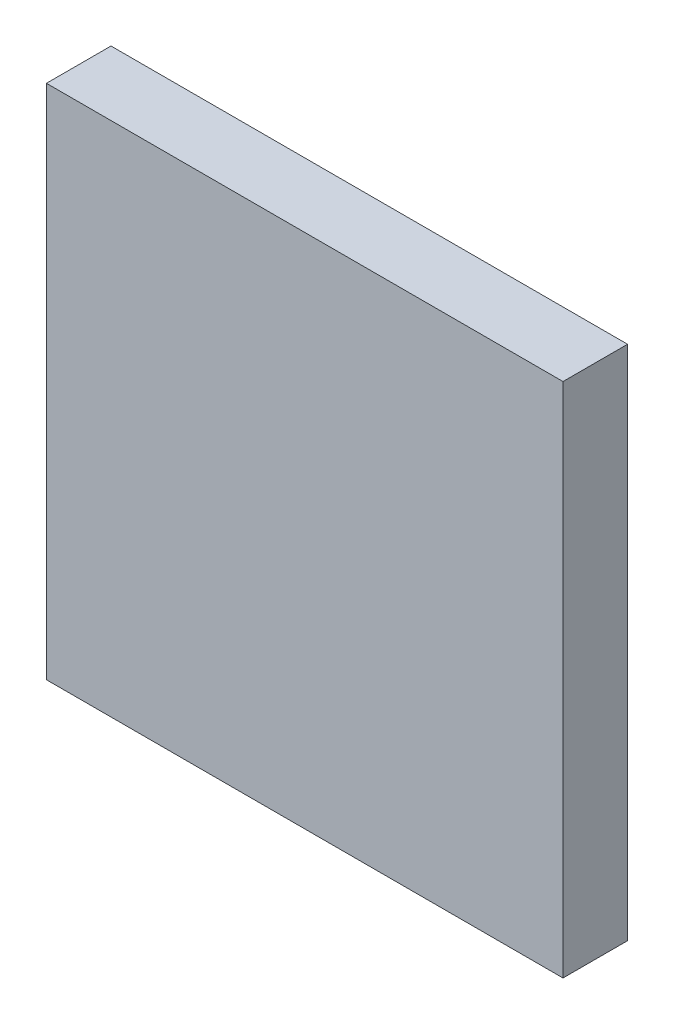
ISO-10303-21;
HEADER;
FILE_DESCRIPTION(('STEP AP214'),'2;1');
FILE_NAME('part.step','',(''),(''),'','','');
FILE_SCHEMA(('AUTOMOTIVE_DESIGN { 1 0 10303 214 1 1 1 1 }'));
ENDSEC;
DATA;
#1=APPLICATION_CONTEXT('core data for automotive mechanical design processes');
#2=APPLICATION_PROTOCOL_DEFINITION('international standard','automotive_design',2000,#1);
#3=PRODUCT_CONTEXT('',#1,'mechanical');
#4=PRODUCT('Part','Part','',(#3));
#5=PRODUCT_RELATED_PRODUCT_CATEGORY('part','',(#4));
#6=PRODUCT_DEFINITION_FORMATION('','',#4);
#7=PRODUCT_DEFINITION_CONTEXT('part definition',#1,'design');
#8=PRODUCT_DEFINITION('design','',#6,#7);
#9=PRODUCT_DEFINITION_SHAPE('','',#8);
#10=(LENGTH_UNIT() NAMED_UNIT(*) SI_UNIT(.MILLI.,.METRE.));
#11=(NAMED_UNIT(*) PLANE_ANGLE_UNIT() SI_UNIT($,.RADIAN.));
#12=(NAMED_UNIT(*) SI_UNIT($,.STERADIAN.) SOLID_ANGLE_UNIT());
#13=UNCERTAINTY_MEASURE_WITH_UNIT(LENGTH_MEASURE(1.E-05),#10,'distance_accuracy_value','');
#14=(GEOMETRIC_REPRESENTATION_CONTEXT(3) GLOBAL_UNCERTAINTY_ASSIGNED_CONTEXT((#13)) GLOBAL_UNIT_ASSIGNED_CONTEXT((#10,
#11,#12)) REPRESENTATION_CONTEXT('',''));
#15=CARTESIAN_POINT('',(0.,0.,0.));
#16=DIRECTION('',(0.,0.,1.));
#17=DIRECTION('',(1.,0.,0.));
#18=AXIS2_PLACEMENT_3D('',#15,#16,#17);
#19=CARTESIAN_POINT('',(76.2,76.2,-9.525));
#20=DIRECTION('',(0.,0.,-1.));
#21=DIRECTION('',(0.,1.,0.));
#22=AXIS2_PLACEMENT_3D('',#19,#20,#21);
#23=PLANE('',#22);
#24=DIRECTION('',(0.,-1.,0.));
#25=VECTOR('',#24,1.);
#26=CARTESIAN_POINT('',(-76.2,76.2,-9.525));
#27=LINE('',#26,#25);
#28=CARTESIAN_POINT('',(-76.2,76.2,-9.525));
#29=VERTEX_POINT('',#28);
#30=CARTESIAN_POINT('',(-76.2,-76.2,-9.52500000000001));
#31=VERTEX_POINT('',#30);
#32=EDGE_CURVE('E74',#29,#31,#27,.T.);
#33=ORIENTED_EDGE('',*,*,#32,.F.);
#34=DIRECTION('',(-1.,0.,0.));
#35=VECTOR('',#34,1.);
#36=CARTESIAN_POINT('',(76.2,76.2,-9.525));
#37=LINE('',#36,#35);
#38=CARTESIAN_POINT('',(76.2,76.2,-9.525));
#39=VERTEX_POINT('',#38);
#40=EDGE_CURVE('E11',#39,#29,#37,.T.);
#41=ORIENTED_EDGE('',*,*,#40,.F.);
#42=DIRECTION('',(0.,-1.,0.));
#43=VECTOR('',#42,1.);
#44=CARTESIAN_POINT('',(76.2,76.2,-9.525));
#45=LINE('',#44,#43);
#46=CARTESIAN_POINT('',(76.2,-76.2,-9.52500000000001));
#47=VERTEX_POINT('',#46);
#48=EDGE_CURVE('E75',#39,#47,#45,.T.);
#49=ORIENTED_EDGE('',*,*,#48,.T.);
#50=DIRECTION('',(-1.,0.,0.));
#51=VECTOR('',#50,1.);
#52=CARTESIAN_POINT('',(76.2,-76.2,-9.52500000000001));
#53=LINE('',#52,#51);
#54=EDGE_CURVE('E35',#47,#31,#53,.T.);
#55=ORIENTED_EDGE('',*,*,#54,.T.);
#56=EDGE_LOOP('',(#33,#41,#49,#55));
#57=FACE_BOUND('',#56,.T.);
#58=ADVANCED_FACE('F32',(#57),#23,.T.);
#59=CARTESIAN_POINT('',(76.2,76.2,-9.525));
#60=DIRECTION('',(0.,-1.,0.));
#61=DIRECTION('',(0.,0.,-1.));
#62=AXIS2_PLACEMENT_3D('',#59,#60,#61);
#63=PLANE('',#62);
#64=DIRECTION('',(0.,0.,1.));
#65=VECTOR('',#64,1.);
#66=CARTESIAN_POINT('',(-76.2,76.2,-9.525));
#67=LINE('',#66,#65);
#68=CARTESIAN_POINT('',(-76.2,76.2,9.52499999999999));
#69=VERTEX_POINT('',#68);
#70=EDGE_CURVE('E90',#29,#69,#67,.T.);
#71=ORIENTED_EDGE('',*,*,#70,.T.);
#72=DIRECTION('',(-1.,0.,0.));
#73=VECTOR('',#72,1.);
#74=CARTESIAN_POINT('',(76.2,76.2,9.52499999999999));
#75=LINE('',#74,#73);
#76=CARTESIAN_POINT('',(76.2,76.2,9.52499999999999));
#77=VERTEX_POINT('',#76);
#78=EDGE_CURVE('E40',#77,#69,#75,.T.);
#79=ORIENTED_EDGE('',*,*,#78,.F.);
#80=DIRECTION('',(0.,0.,1.));
#81=VECTOR('',#80,1.);
#82=CARTESIAN_POINT('',(76.2,76.2,-9.525));
#83=LINE('',#82,#81);
#84=EDGE_CURVE('E53',#39,#77,#83,.T.);
#85=ORIENTED_EDGE('',*,*,#84,.F.);
#86=ORIENTED_EDGE('',*,*,#40,.T.);
#87=EDGE_LOOP('',(#71,#79,#85,#86));
#88=FACE_BOUND('',#87,.T.);
#89=ADVANCED_FACE('F105',(#88),#63,.F.);
#90=CARTESIAN_POINT('',(76.2,-76.2,9.52499999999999));
#91=DIRECTION('',(0.,0.,1.));
#92=DIRECTION('',(1.,0.,0.));
#93=AXIS2_PLACEMENT_3D('',#90,#91,#92);
#94=PLANE('',#93);
#95=DIRECTION('',(0.,1.,0.));
#96=VECTOR('',#95,1.);
#97=CARTESIAN_POINT('',(-76.2,-76.2,9.52499999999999));
#98=LINE('',#97,#96);
#99=CARTESIAN_POINT('',(-76.2,-76.2,9.52499999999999));
#100=VERTEX_POINT('',#99);
#101=EDGE_CURVE('E85',#100,#69,#98,.T.);
#102=ORIENTED_EDGE('',*,*,#101,.F.);
#103=DIRECTION('',(-1.,0.,0.));
#104=VECTOR('',#103,1.);
#105=CARTESIAN_POINT('',(76.2,-76.2,9.52499999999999));
#106=LINE('',#105,#104);
#107=CARTESIAN_POINT('',(76.2,-76.2,9.52499999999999));
#108=VERTEX_POINT('',#107);
#109=EDGE_CURVE('E78',#108,#100,#106,.T.);
#110=ORIENTED_EDGE('',*,*,#109,.F.);
#111=DIRECTION('',(0.,1.,0.));
#112=VECTOR('',#111,1.);
#113=CARTESIAN_POINT('',(76.2,-76.2,9.52499999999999));
#114=LINE('',#113,#112);
#115=EDGE_CURVE('E98',#108,#77,#114,.T.);
#116=ORIENTED_EDGE('',*,*,#115,.T.);
#117=ORIENTED_EDGE('',*,*,#78,.T.);
#118=EDGE_LOOP('',(#102,#110,#116,#117));
#119=FACE_BOUND('',#118,.T.);
#120=ADVANCED_FACE('F103',(#119),#94,.T.);
#121=CARTESIAN_POINT('',(76.2,-76.2,9.52499999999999));
#122=DIRECTION('',(0.,1.,0.));
#123=DIRECTION('',(0.,0.,1.));
#124=AXIS2_PLACEMENT_3D('',#121,#122,#123);
#125=PLANE('',#124);
#126=DIRECTION('',(0.,0.,-1.));
#127=VECTOR('',#126,1.);
#128=CARTESIAN_POINT('',(-76.2,-76.2,9.52499999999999));
#129=LINE('',#128,#127);
#130=EDGE_CURVE('E80',#100,#31,#129,.T.);
#131=ORIENTED_EDGE('',*,*,#130,.T.);
#132=ORIENTED_EDGE('',*,*,#54,.F.);
#133=DIRECTION('',(0.,0.,-1.));
#134=VECTOR('',#133,1.);
#135=CARTESIAN_POINT('',(76.2,-76.2,9.52499999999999));
#136=LINE('',#135,#134);
#137=EDGE_CURVE('E96',#108,#47,#136,.T.);
#138=ORIENTED_EDGE('',*,*,#137,.F.);
#139=ORIENTED_EDGE('',*,*,#109,.T.);
#140=EDGE_LOOP('',(#131,#132,#138,#139));
#141=FACE_BOUND('',#140,.T.);
#142=ADVANCED_FACE('F81',(#141),#125,.F.);
#143=CARTESIAN_POINT('',(76.2,-76.2,-9.52500000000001));
#144=DIRECTION('',(1.,0.,0.));
#145=DIRECTION('',(0.,0.,-1.));
#146=AXIS2_PLACEMENT_3D('',#143,#144,#145);
#147=PLANE('',#146);
#148=ORIENTED_EDGE('',*,*,#48,.F.);
#149=ORIENTED_EDGE('',*,*,#84,.T.);
#150=ORIENTED_EDGE('',*,*,#115,.F.);
#151=ORIENTED_EDGE('',*,*,#137,.T.);
#152=EDGE_LOOP('',(#148,#149,#150,#151));
#153=FACE_BOUND('',#152,.T.);
#154=ADVANCED_FACE('F106',(#153),#147,.T.);
#155=CARTESIAN_POINT('',(-76.2,-76.2,-9.52500000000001));
#156=DIRECTION('',(1.,0.,0.));
#157=DIRECTION('',(0.,0.,-1.));
#158=AXIS2_PLACEMENT_3D('',#155,#156,#157);
#159=PLANE('',#158);
#160=ORIENTED_EDGE('',*,*,#32,.T.);
#161=ORIENTED_EDGE('',*,*,#130,.F.);
#162=ORIENTED_EDGE('',*,*,#101,.T.);
#163=ORIENTED_EDGE('',*,*,#70,.F.);
#164=EDGE_LOOP('',(#160,#161,#162,#163));
#165=FACE_BOUND('',#164,.T.);
#166=ADVANCED_FACE('F88',(#165),#159,.F.);
#167=CLOSED_SHELL('',(#58,#89,#120,#142,#154,#166));
#168=MANIFOLD_SOLID_BREP('B2',#167);
#169=ADVANCED_BREP_SHAPE_REPRESENTATION('',(#18,#168),#14);
#170=SHAPE_DEFINITION_REPRESENTATION(#9,#169);
ENDSEC;
END-ISO-10303-21;
